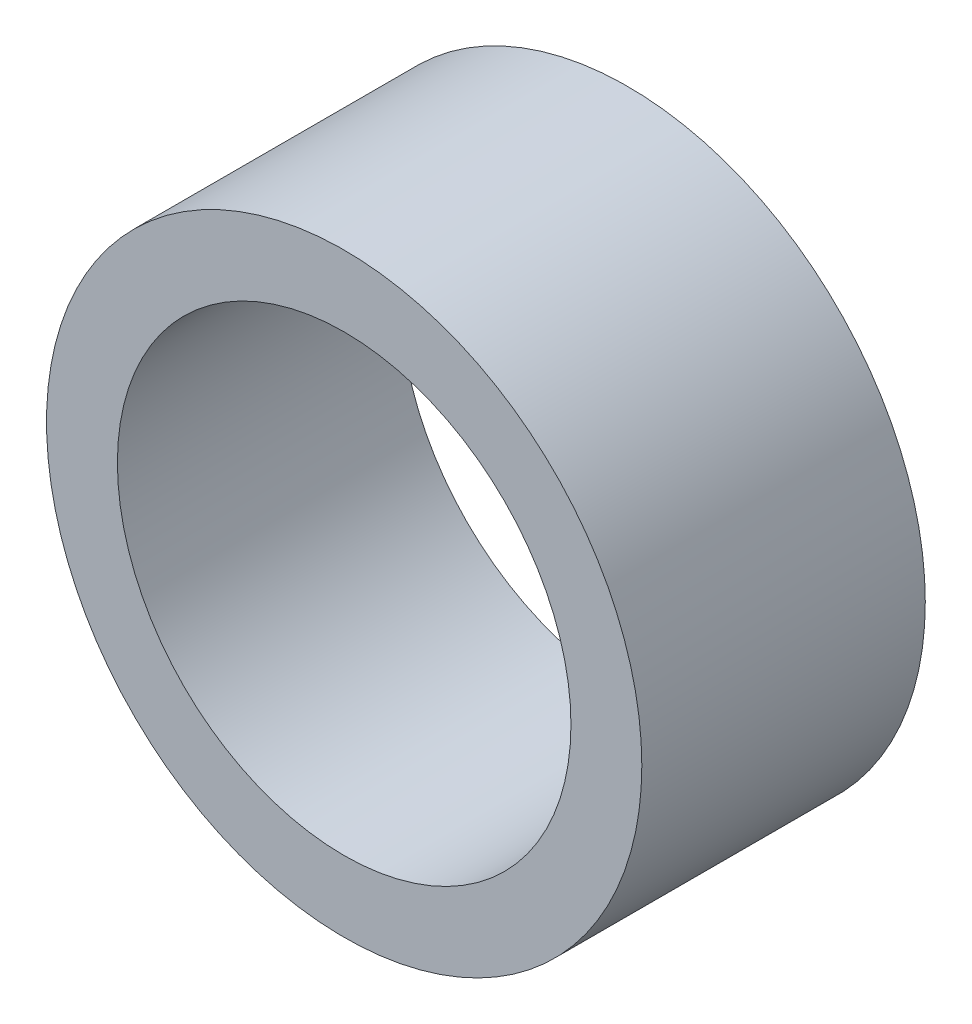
ISO-10303-21;
HEADER;
FILE_DESCRIPTION(('STEP AP214'),'2;1');
FILE_NAME('part.step','',(''),(''),'','','');
FILE_SCHEMA(('AUTOMOTIVE_DESIGN { 1 0 10303 214 1 1 1 1 }'));
ENDSEC;
DATA;
#1=APPLICATION_CONTEXT('core data for automotive mechanical design processes');
#2=APPLICATION_PROTOCOL_DEFINITION('international standard','automotive_design',2000,#1);
#3=PRODUCT_CONTEXT('',#1,'mechanical');
#4=PRODUCT('Part','Part','',(#3));
#5=PRODUCT_RELATED_PRODUCT_CATEGORY('part','',(#4));
#6=PRODUCT_DEFINITION_FORMATION('','',#4);
#7=PRODUCT_DEFINITION_CONTEXT('part definition',#1,'design');
#8=PRODUCT_DEFINITION('design','',#6,#7);
#9=PRODUCT_DEFINITION_SHAPE('','',#8);
#10=(LENGTH_UNIT() NAMED_UNIT(*) SI_UNIT(.MILLI.,.METRE.));
#11=(NAMED_UNIT(*) PLANE_ANGLE_UNIT() SI_UNIT($,.RADIAN.));
#12=(NAMED_UNIT(*) SI_UNIT($,.STERADIAN.) SOLID_ANGLE_UNIT());
#13=UNCERTAINTY_MEASURE_WITH_UNIT(LENGTH_MEASURE(1.E-05),#10,'distance_accuracy_value','');
#14=(GEOMETRIC_REPRESENTATION_CONTEXT(3) GLOBAL_UNCERTAINTY_ASSIGNED_CONTEXT((#13)) GLOBAL_UNIT_ASSIGNED_CONTEXT((#10,
#11,#12)) REPRESENTATION_CONTEXT('',''));
#15=CARTESIAN_POINT('',(0.,0.,0.));
#16=DIRECTION('',(0.,0.,1.));
#17=DIRECTION('',(1.,0.,0.));
#18=AXIS2_PLACEMENT_3D('',#15,#16,#17);
#19=CARTESIAN_POINT('',(0.,0.,10.));
#20=DIRECTION('',(0.,0.,-1.));
#21=DIRECTION('',(0.,1.,0.));
#22=AXIS2_PLACEMENT_3D('',#19,#20,#21);
#23=CYLINDRICAL_SURFACE('',#22,8.);
#24=CARTESIAN_POINT('',(0.,0.,10.));
#25=DIRECTION('',(0.,0.,-1.));
#26=DIRECTION('',(1.,0.,0.));
#27=AXIS2_PLACEMENT_3D('',#24,#25,#26);
#28=CIRCLE('',#27,8.);
#29=CARTESIAN_POINT('',(8.,0.,10.));
#30=VERTEX_POINT('',#29);
#31=EDGE_CURVE('E8',#30,#30,#28,.T.);
#32=ORIENTED_EDGE('',*,*,#31,.F.);
#33=EDGE_LOOP('',(#32));
#34=FACE_BOUND('',#33,.T.);
#35=CARTESIAN_POINT('',(0.,0.,0.));
#36=DIRECTION('',(0.,0.,-1.));
#37=DIRECTION('',(1.,0.,0.));
#38=AXIS2_PLACEMENT_3D('',#35,#36,#37);
#39=CIRCLE('',#38,8.);
#40=CARTESIAN_POINT('',(8.,0.,0.));
#41=VERTEX_POINT('',#40);
#42=EDGE_CURVE('E23',#41,#41,#39,.T.);
#43=ORIENTED_EDGE('',*,*,#42,.T.);
#44=EDGE_LOOP('',(#43));
#45=FACE_BOUND('',#44,.T.);
#46=ADVANCED_FACE('F12',(#34,#45),#23,.F.);
#47=CARTESIAN_POINT('',(0.,0.,10.));
#48=DIRECTION('',(0.,0.,-1.));
#49=DIRECTION('',(0.,1.,0.));
#50=AXIS2_PLACEMENT_3D('',#47,#48,#49);
#51=CYLINDRICAL_SURFACE('',#50,10.5);
#52=CARTESIAN_POINT('',(0.,0.,10.));
#53=DIRECTION('',(0.,0.,-1.));
#54=DIRECTION('',(1.,0.,0.));
#55=AXIS2_PLACEMENT_3D('',#52,#53,#54);
#56=CIRCLE('',#55,10.5);
#57=CARTESIAN_POINT('',(10.5,0.,10.));
#58=VERTEX_POINT('',#57);
#59=EDGE_CURVE('E19',#58,#58,#56,.T.);
#60=ORIENTED_EDGE('',*,*,#59,.T.);
#61=EDGE_LOOP('',(#60));
#62=FACE_BOUND('',#61,.T.);
#63=CARTESIAN_POINT('',(0.,0.,0.));
#64=DIRECTION('',(0.,0.,-1.));
#65=DIRECTION('',(1.,0.,0.));
#66=AXIS2_PLACEMENT_3D('',#63,#64,#65);
#67=CIRCLE('',#66,10.5);
#68=CARTESIAN_POINT('',(10.5,0.,0.));
#69=VERTEX_POINT('',#68);
#70=EDGE_CURVE('E28',#69,#69,#67,.T.);
#71=ORIENTED_EDGE('',*,*,#70,.F.);
#72=EDGE_LOOP('',(#71));
#73=FACE_BOUND('',#72,.T.);
#74=ADVANCED_FACE('F14',(#62,#73),#51,.T.);
#75=CARTESIAN_POINT('',(0.,0.,10.));
#76=DIRECTION('',(0.,0.,-1.));
#77=DIRECTION('',(0.,1.,0.));
#78=AXIS2_PLACEMENT_3D('',#75,#76,#77);
#79=PLANE('',#78);
#80=ORIENTED_EDGE('',*,*,#31,.T.);
#81=EDGE_LOOP('',(#80));
#82=FACE_BOUND('',#81,.T.);
#83=ORIENTED_EDGE('',*,*,#59,.F.);
#84=EDGE_LOOP('',(#83));
#85=FACE_BOUND('',#84,.T.);
#86=ADVANCED_FACE('F40',(#82,#85),#79,.F.);
#87=CARTESIAN_POINT('',(0.,0.,0.));
#88=DIRECTION('',(0.,0.,-1.));
#89=DIRECTION('',(0.,1.,0.));
#90=AXIS2_PLACEMENT_3D('',#87,#88,#89);
#91=PLANE('',#90);
#92=ORIENTED_EDGE('',*,*,#42,.F.);
#93=EDGE_LOOP('',(#92));
#94=FACE_BOUND('',#93,.T.);
#95=ORIENTED_EDGE('',*,*,#70,.T.);
#96=EDGE_LOOP('',(#95));
#97=FACE_BOUND('',#96,.T.);
#98=ADVANCED_FACE('F37',(#94,#97),#91,.T.);
#99=CLOSED_SHELL('',(#46,#74,#86,#98));
#100=MANIFOLD_SOLID_BREP('B1',#99);
#101=ADVANCED_BREP_SHAPE_REPRESENTATION('',(#18,#100),#14);
#102=SHAPE_DEFINITION_REPRESENTATION(#9,#101);
ENDSEC;
END-ISO-10303-21;
